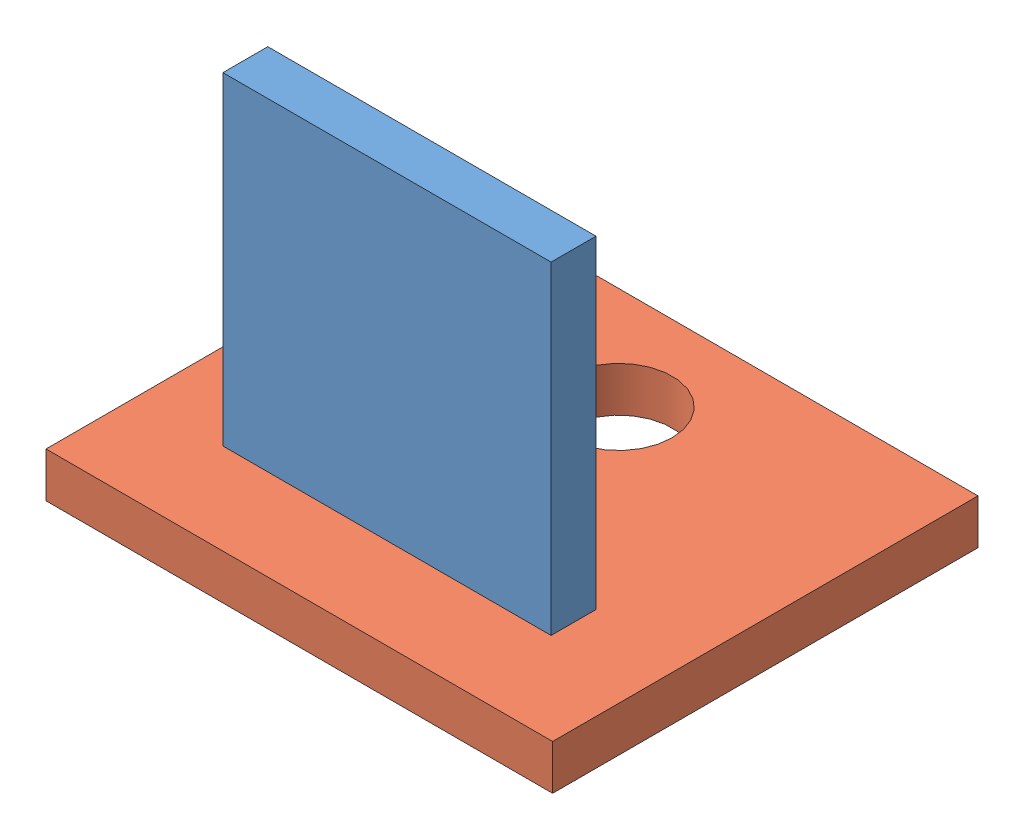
SolidWorks assembly Assem1.SLDASM, configuration Default (file format 9000). Lengths in mm.
Overall size (56.41 41 47.36).
2 component instances, 2 part files, 3 mates.
Components (placement in the parent):
- Part1-1: Part1.SLDPRT [Default] at (-7.2082 -3.9157 -69.3424) size (36.54 36 5)
- Part2-1: Part2.SLDPRT [Default] at (-7.2082 -22.5885 -81.85) x (1 0 0) z (0 -1 0) size (56.41 47.36 5)
Mates (geometry in assembly coordinates):
- Coincident1: coincident: line of Part2-1 through (2.5115 -22.5885 -64.3424) axis (-1 0 0); line of ?; plane of Part1-1 through (-34.0285 -22.5885 -64.3424) normal (0 -1 0)
- Coincident2: coincident: line of Part1-1 through (-34.0285 -22.5885 -64.3424) axis (0 0 -1); line of Part2-1 through (-34.0285 -22.5885 -64.3424) axis (0 0 -1)
- Coincident3: coincident: line of Part1-1 through (-34.0285 -22.5885 -64.3424) axis (1 0 0); line of Part2-1 through (2.5115 -22.5885 -64.3424) axis (-1 0 0); line of ?
